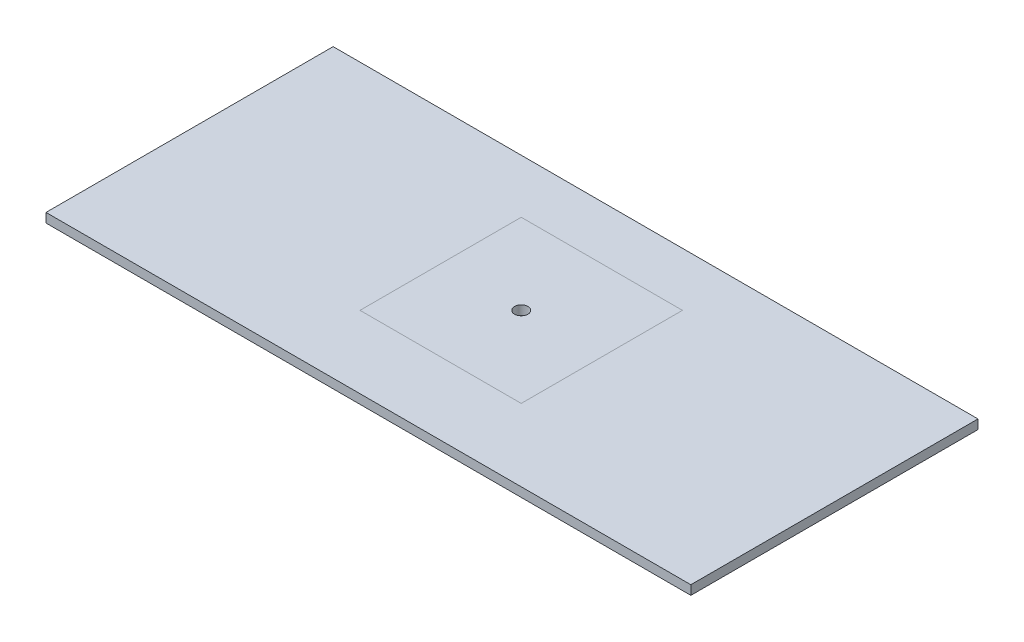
ISO-10303-21;
HEADER;
FILE_DESCRIPTION(('STEP AP214'),'2;1');
FILE_NAME('part.step','',(''),(''),'','','');
FILE_SCHEMA(('AUTOMOTIVE_DESIGN { 1 0 10303 214 1 1 1 1 }'));
ENDSEC;
DATA;
#1=APPLICATION_CONTEXT('core data for automotive mechanical design processes');
#2=APPLICATION_PROTOCOL_DEFINITION('international standard','automotive_design',2000,#1);
#3=PRODUCT_CONTEXT('',#1,'mechanical');
#4=PRODUCT('Part','Part','',(#3));
#5=PRODUCT_RELATED_PRODUCT_CATEGORY('part','',(#4));
#6=PRODUCT_DEFINITION_FORMATION('','',#4);
#7=PRODUCT_DEFINITION_CONTEXT('part definition',#1,'design');
#8=PRODUCT_DEFINITION('design','',#6,#7);
#9=PRODUCT_DEFINITION_SHAPE('','',#8);
#10=(LENGTH_UNIT() NAMED_UNIT(*) SI_UNIT(.MILLI.,.METRE.));
#11=(NAMED_UNIT(*) PLANE_ANGLE_UNIT() SI_UNIT($,.RADIAN.));
#12=(NAMED_UNIT(*) SI_UNIT($,.STERADIAN.) SOLID_ANGLE_UNIT());
#13=UNCERTAINTY_MEASURE_WITH_UNIT(LENGTH_MEASURE(1.E-05),#10,'distance_accuracy_value','');
#14=(GEOMETRIC_REPRESENTATION_CONTEXT(3) GLOBAL_UNCERTAINTY_ASSIGNED_CONTEXT((#13)) GLOBAL_UNIT_ASSIGNED_CONTEXT((#10,
#11,#12)) REPRESENTATION_CONTEXT('',''));
#15=CARTESIAN_POINT('',(0.,0.,0.));
#16=DIRECTION('',(0.,0.,1.));
#17=DIRECTION('',(1.,0.,0.));
#18=AXIS2_PLACEMENT_3D('',#15,#16,#17);
#19=CARTESIAN_POINT('',(-609.6,-8.73125,542.925));
#20=DIRECTION('',(-1.,0.,0.));
#21=DIRECTION('',(0.,0.,1.));
#22=AXIS2_PLACEMENT_3D('',#19,#20,#21);
#23=PLANE('',#22);
#24=DIRECTION('',(0.,1.,0.));
#25=VECTOR('',#24,1.);
#26=CARTESIAN_POINT('',(-609.6,-8.73125,0.));
#27=LINE('',#26,#25);
#28=CARTESIAN_POINT('',(-609.6,-8.73125,0.));
#29=VERTEX_POINT('',#28);
#30=CARTESIAN_POINT('',(-609.6,8.73125,0.));
#31=VERTEX_POINT('',#30);
#32=EDGE_CURVE('E148',#29,#31,#27,.T.);
#33=ORIENTED_EDGE('',*,*,#32,.F.);
#34=DIRECTION('',(0.,0.,-1.));
#35=VECTOR('',#34,1.);
#36=CARTESIAN_POINT('',(-609.6,-8.73125,542.925));
#37=LINE('',#36,#35);
#38=CARTESIAN_POINT('',(-609.6,-8.73125,542.925));
#39=VERTEX_POINT('',#38);
#40=EDGE_CURVE('E11',#39,#29,#37,.T.);
#41=ORIENTED_EDGE('',*,*,#40,.F.);
#42=DIRECTION('',(0.,1.,0.));
#43=VECTOR('',#42,1.);
#44=CARTESIAN_POINT('',(-609.6,-8.73125,542.925));
#45=LINE('',#44,#43);
#46=CARTESIAN_POINT('',(-609.6,8.73125,542.925));
#47=VERTEX_POINT('',#46);
#48=EDGE_CURVE('E149',#39,#47,#45,.T.);
#49=ORIENTED_EDGE('',*,*,#48,.T.);
#50=DIRECTION('',(0.,0.,-1.));
#51=VECTOR('',#50,1.);
#52=CARTESIAN_POINT('',(-609.6,8.73125,542.925));
#53=LINE('',#52,#51);
#54=EDGE_CURVE('E37',#47,#31,#53,.T.);
#55=ORIENTED_EDGE('',*,*,#54,.T.);
#56=EDGE_LOOP('',(#33,#41,#49,#55));
#57=FACE_BOUND('',#56,.T.);
#58=ADVANCED_FACE('F34',(#57),#23,.T.);
#59=CARTESIAN_POINT('',(-609.6,-8.73125,542.925));
#60=DIRECTION('',(0.,1.,0.));
#61=DIRECTION('',(0.,0.,1.));
#62=AXIS2_PLACEMENT_3D('',#59,#60,#61);
#63=PLANE('',#62);
#64=CARTESIAN_POINT('',(0.,-8.73125,254.));
#65=DIRECTION('',(0.,1.,0.));
#66=DIRECTION('',(0.,0.,1.));
#67=AXIS2_PLACEMENT_3D('',#64,#65,#66);
#68=CIRCLE('',#67,12.7);
#69=CARTESIAN_POINT('',(0.,-8.73125,266.7));
#70=VERTEX_POINT('',#69);
#71=EDGE_CURVE('E142',#70,#70,#68,.T.);
#72=ORIENTED_EDGE('',*,*,#71,.T.);
#73=EDGE_LOOP('',(#72));
#74=FACE_BOUND('',#73,.T.);
#75=DIRECTION('',(1.,0.,0.));
#76=VECTOR('',#75,1.);
#77=CARTESIAN_POINT('',(-609.6,-8.73125,0.));
#78=LINE('',#77,#76);
#79=CARTESIAN_POINT('',(609.6,-8.73125,0.));
#80=VERTEX_POINT('',#79);
#81=EDGE_CURVE('E152',#29,#80,#78,.T.);
#82=ORIENTED_EDGE('',*,*,#81,.T.);
#83=DIRECTION('',(0.,0.,-1.));
#84=VECTOR('',#83,1.);
#85=CARTESIAN_POINT('',(609.6,-8.73125,542.925));
#86=LINE('',#85,#84);
#87=CARTESIAN_POINT('',(609.6,-8.73125,542.925));
#88=VERTEX_POINT('',#87);
#89=EDGE_CURVE('E42',#88,#80,#86,.T.);
#90=ORIENTED_EDGE('',*,*,#89,.F.);
#91=DIRECTION('',(1.,0.,0.));
#92=VECTOR('',#91,1.);
#93=CARTESIAN_POINT('',(-609.6,-8.73125,542.925));
#94=LINE('',#93,#92);
#95=EDGE_CURVE('E156',#39,#88,#94,.T.);
#96=ORIENTED_EDGE('',*,*,#95,.F.);
#97=ORIENTED_EDGE('',*,*,#40,.T.);
#98=EDGE_LOOP('',(#82,#90,#96,#97));
#99=FACE_BOUND('',#98,.T.);
#100=ADVANCED_FACE('F176',(#74,#99),#63,.F.);
#101=CARTESIAN_POINT('',(609.6,-8.73125,542.925));
#102=DIRECTION('',(-1.,0.,0.));
#103=DIRECTION('',(0.,0.,1.));
#104=AXIS2_PLACEMENT_3D('',#101,#102,#103);
#105=PLANE('',#104);
#106=DIRECTION('',(0.,1.,0.));
#107=VECTOR('',#106,1.);
#108=CARTESIAN_POINT('',(609.6,-8.73125,0.));
#109=LINE('',#108,#107);
#110=CARTESIAN_POINT('',(609.6,8.73125,0.));
#111=VERTEX_POINT('',#110);
#112=EDGE_CURVE('E163',#80,#111,#109,.T.);
#113=ORIENTED_EDGE('',*,*,#112,.T.);
#114=DIRECTION('',(0.,0.,-1.));
#115=VECTOR('',#114,1.);
#116=CARTESIAN_POINT('',(609.6,8.73125,542.925));
#117=LINE('',#116,#115);
#118=CARTESIAN_POINT('',(609.6,8.73125,542.925));
#119=VERTEX_POINT('',#118);
#120=EDGE_CURVE('E168',#119,#111,#117,.T.);
#121=ORIENTED_EDGE('',*,*,#120,.F.);
#122=DIRECTION('',(0.,1.,0.));
#123=VECTOR('',#122,1.);
#124=CARTESIAN_POINT('',(609.6,-8.73125,542.925));
#125=LINE('',#124,#123);
#126=EDGE_CURVE('E154',#88,#119,#125,.T.);
#127=ORIENTED_EDGE('',*,*,#126,.F.);
#128=ORIENTED_EDGE('',*,*,#89,.T.);
#129=EDGE_LOOP('',(#113,#121,#127,#128));
#130=FACE_BOUND('',#129,.T.);
#131=ADVANCED_FACE('F179',(#130),#105,.F.);
#132=CARTESIAN_POINT('',(-609.6,8.73125,542.925));
#133=DIRECTION('',(0.,1.,0.));
#134=DIRECTION('',(0.,0.,1.));
#135=AXIS2_PLACEMENT_3D('',#132,#133,#134);
#136=PLANE('',#135);
#137=DIRECTION('',(0.,0.,-1.));
#138=VECTOR('',#137,1.);
#139=CARTESIAN_POINT('',(152.4,8.73125,406.4));
#140=LINE('',#139,#138);
#141=CARTESIAN_POINT('',(152.4,8.73125,406.4));
#142=VERTEX_POINT('',#141);
#143=CARTESIAN_POINT('',(152.4,8.73125,101.6));
#144=VERTEX_POINT('',#143);
#145=EDGE_CURVE('E50',#142,#144,#140,.T.);
#146=ORIENTED_EDGE('',*,*,#145,.F.);
#147=DIRECTION('',(1.,0.,0.));
#148=VECTOR('',#147,1.);
#149=CARTESIAN_POINT('',(-152.4,8.73125,406.4));
#150=LINE('',#149,#148);
#151=CARTESIAN_POINT('',(-152.4,8.73125,406.4));
#152=VERTEX_POINT('',#151);
#153=EDGE_CURVE('E125',#152,#142,#150,.T.);
#154=ORIENTED_EDGE('',*,*,#153,.F.);
#155=DIRECTION('',(0.,0.,1.));
#156=VECTOR('',#155,1.);
#157=CARTESIAN_POINT('',(-152.4,8.73125,406.4));
#158=LINE('',#157,#156);
#159=CARTESIAN_POINT('',(-152.4,8.73125,101.6));
#160=VERTEX_POINT('',#159);
#161=EDGE_CURVE('E128',#160,#152,#158,.T.);
#162=ORIENTED_EDGE('',*,*,#161,.F.);
#163=DIRECTION('',(-1.,0.,0.));
#164=VECTOR('',#163,1.);
#165=CARTESIAN_POINT('',(-152.4,8.73125,101.6));
#166=LINE('',#165,#164);
#167=EDGE_CURVE('E136',#144,#160,#166,.T.);
#168=ORIENTED_EDGE('',*,*,#167,.F.);
#169=EDGE_LOOP('',(#146,#154,#162,#168));
#170=FACE_BOUND('',#169,.T.);
#171=DIRECTION('',(1.,0.,0.));
#172=VECTOR('',#171,1.);
#173=CARTESIAN_POINT('',(-609.6,8.73125,0.));
#174=LINE('',#173,#172);
#175=EDGE_CURVE('E160',#31,#111,#174,.T.);
#176=ORIENTED_EDGE('',*,*,#175,.F.);
#177=ORIENTED_EDGE('',*,*,#54,.F.);
#178=DIRECTION('',(1.,0.,0.));
#179=VECTOR('',#178,1.);
#180=CARTESIAN_POINT('',(-609.6,8.73125,542.925));
#181=LINE('',#180,#179);
#182=EDGE_CURVE('E151',#47,#119,#181,.T.);
#183=ORIENTED_EDGE('',*,*,#182,.T.);
#184=ORIENTED_EDGE('',*,*,#120,.T.);
#185=EDGE_LOOP('',(#176,#177,#183,#184));
#186=FACE_BOUND('',#185,.T.);
#187=ADVANCED_FACE('F171',(#170,#186),#136,.T.);
#188=CARTESIAN_POINT('',(0.,0.,542.925));
#189=DIRECTION('',(0.,0.,-1.));
#190=DIRECTION('',(-1.,0.,0.));
#191=AXIS2_PLACEMENT_3D('',#188,#189,#190);
#192=PLANE('',#191);
#193=ORIENTED_EDGE('',*,*,#48,.F.);
#194=ORIENTED_EDGE('',*,*,#95,.T.);
#195=ORIENTED_EDGE('',*,*,#126,.T.);
#196=ORIENTED_EDGE('',*,*,#182,.F.);
#197=EDGE_LOOP('',(#193,#194,#195,#196));
#198=FACE_BOUND('',#197,.T.);
#199=ADVANCED_FACE('F181',(#198),#192,.F.);
#200=CARTESIAN_POINT('',(0.,0.,0.));
#201=DIRECTION('',(0.,0.,-1.));
#202=DIRECTION('',(-1.,0.,0.));
#203=AXIS2_PLACEMENT_3D('',#200,#201,#202);
#204=PLANE('',#203);
#205=ORIENTED_EDGE('',*,*,#32,.T.);
#206=ORIENTED_EDGE('',*,*,#175,.T.);
#207=ORIENTED_EDGE('',*,*,#112,.F.);
#208=ORIENTED_EDGE('',*,*,#81,.F.);
#209=EDGE_LOOP('',(#205,#206,#207,#208));
#210=FACE_BOUND('',#209,.T.);
#211=ADVANCED_FACE('F174',(#210),#204,.T.);
#212=CARTESIAN_POINT('',(0.,-8.73125,254.));
#213=DIRECTION('',(0.,1.,0.));
#214=DIRECTION('',(0.,0.,1.));
#215=AXIS2_PLACEMENT_3D('',#212,#213,#214);
#216=CYLINDRICAL_SURFACE('',#215,12.7);
#217=CARTESIAN_POINT('',(0.,8.730996,254.));
#218=DIRECTION('',(0.,1.,0.));
#219=DIRECTION('',(0.,0.,1.));
#220=AXIS2_PLACEMENT_3D('',#217,#218,#219);
#221=CIRCLE('',#220,12.7);
#222=CARTESIAN_POINT('',(0.,8.730996,266.7));
#223=VERTEX_POINT('',#222);
#224=EDGE_CURVE('E131',#223,#223,#221,.T.);
#225=ORIENTED_EDGE('',*,*,#224,.T.);
#226=EDGE_LOOP('',(#225));
#227=FACE_BOUND('',#226,.T.);
#228=ORIENTED_EDGE('',*,*,#71,.F.);
#229=EDGE_LOOP('',(#228));
#230=FACE_BOUND('',#229,.T.);
#231=ADVANCED_FACE('F188',(#227,#230),#216,.F.);
#232=CARTESIAN_POINT('',(152.4,8.730996,406.4));
#233=DIRECTION('',(1.,0.,0.));
#234=DIRECTION('',(0.,0.,-1.));
#235=AXIS2_PLACEMENT_3D('',#232,#233,#234);
#236=PLANE('',#235);
#237=ORIENTED_EDGE('',*,*,#145,.T.);
#238=DIRECTION('',(0.,1.,0.));
#239=VECTOR('',#238,1.);
#240=CARTESIAN_POINT('',(152.4,8.730996,101.6));
#241=LINE('',#240,#239);
#242=CARTESIAN_POINT('',(152.4,8.730996,101.6));
#243=VERTEX_POINT('',#242);
#244=EDGE_CURVE('E103',#243,#144,#241,.T.);
#245=ORIENTED_EDGE('',*,*,#244,.F.);
#246=DIRECTION('',(0.,0.,-1.));
#247=VECTOR('',#246,1.);
#248=CARTESIAN_POINT('',(152.4,8.730996,406.4));
#249=LINE('',#248,#247);
#250=CARTESIAN_POINT('',(152.4,8.730996,406.4));
#251=VERTEX_POINT('',#250);
#252=EDGE_CURVE('E107',#251,#243,#249,.T.);
#253=ORIENTED_EDGE('',*,*,#252,.F.);
#254=DIRECTION('',(0.,1.,0.));
#255=VECTOR('',#254,1.);
#256=CARTESIAN_POINT('',(152.4,8.730996,406.4));
#257=LINE('',#256,#255);
#258=EDGE_CURVE('E140',#251,#142,#257,.T.);
#259=ORIENTED_EDGE('',*,*,#258,.T.);
#260=EDGE_LOOP('',(#237,#245,#253,#259));
#261=FACE_BOUND('',#260,.T.);
#262=ADVANCED_FACE('F105',(#261),#236,.F.);
#263=CARTESIAN_POINT('',(-152.4,8.730996,406.4));
#264=DIRECTION('',(0.,0.,1.));
#265=DIRECTION('',(1.,0.,0.));
#266=AXIS2_PLACEMENT_3D('',#263,#264,#265);
#267=PLANE('',#266);
#268=ORIENTED_EDGE('',*,*,#153,.T.);
#269=ORIENTED_EDGE('',*,*,#258,.F.);
#270=DIRECTION('',(1.,0.,0.));
#271=VECTOR('',#270,1.);
#272=CARTESIAN_POINT('',(-152.4,8.730996,406.4));
#273=LINE('',#272,#271);
#274=CARTESIAN_POINT('',(-152.4,8.730996,406.4));
#275=VERTEX_POINT('',#274);
#276=EDGE_CURVE('E113',#275,#251,#273,.T.);
#277=ORIENTED_EDGE('',*,*,#276,.F.);
#278=DIRECTION('',(0.,1.,0.));
#279=VECTOR('',#278,1.);
#280=CARTESIAN_POINT('',(-152.4,8.730996,406.4));
#281=LINE('',#280,#279);
#282=EDGE_CURVE('E143',#275,#152,#281,.T.);
#283=ORIENTED_EDGE('',*,*,#282,.T.);
#284=EDGE_LOOP('',(#268,#269,#277,#283));
#285=FACE_BOUND('',#284,.T.);
#286=ADVANCED_FACE('F209',(#285),#267,.F.);
#287=CARTESIAN_POINT('',(-152.4,8.730996,406.4));
#288=DIRECTION('',(-1.,0.,0.));
#289=DIRECTION('',(0.,0.,1.));
#290=AXIS2_PLACEMENT_3D('',#287,#288,#289);
#291=PLANE('',#290);
#292=ORIENTED_EDGE('',*,*,#161,.T.);
#293=ORIENTED_EDGE('',*,*,#282,.F.);
#294=DIRECTION('',(0.,0.,1.));
#295=VECTOR('',#294,1.);
#296=CARTESIAN_POINT('',(-152.4,8.730996,406.4));
#297=LINE('',#296,#295);
#298=CARTESIAN_POINT('',(-152.4,8.730996,101.6));
#299=VERTEX_POINT('',#298);
#300=EDGE_CURVE('E121',#299,#275,#297,.T.);
#301=ORIENTED_EDGE('',*,*,#300,.F.);
#302=DIRECTION('',(0.,1.,0.));
#303=VECTOR('',#302,1.);
#304=CARTESIAN_POINT('',(-152.4,8.730996,101.6));
#305=LINE('',#304,#303);
#306=EDGE_CURVE('E112',#299,#160,#305,.T.);
#307=ORIENTED_EDGE('',*,*,#306,.T.);
#308=EDGE_LOOP('',(#292,#293,#301,#307));
#309=FACE_BOUND('',#308,.T.);
#310=ADVANCED_FACE('F215',(#309),#291,.F.);
#311=CARTESIAN_POINT('',(-152.4,8.730996,101.6));
#312=DIRECTION('',(0.,0.,-1.));
#313=DIRECTION('',(-1.,0.,0.));
#314=AXIS2_PLACEMENT_3D('',#311,#312,#313);
#315=PLANE('',#314);
#316=ORIENTED_EDGE('',*,*,#167,.T.);
#317=ORIENTED_EDGE('',*,*,#306,.F.);
#318=DIRECTION('',(-1.,0.,0.));
#319=VECTOR('',#318,1.);
#320=CARTESIAN_POINT('',(-152.4,8.730996,101.6));
#321=LINE('',#320,#319);
#322=EDGE_CURVE('E116',#243,#299,#321,.T.);
#323=ORIENTED_EDGE('',*,*,#322,.F.);
#324=ORIENTED_EDGE('',*,*,#244,.T.);
#325=EDGE_LOOP('',(#316,#317,#323,#324));
#326=FACE_BOUND('',#325,.T.);
#327=ADVANCED_FACE('F117',(#326),#315,.F.);
#328=CARTESIAN_POINT('',(0.,8.730996,0.));
#329=DIRECTION('',(0.,-1.,0.));
#330=DIRECTION('',(0.,0.,-1.));
#331=AXIS2_PLACEMENT_3D('',#328,#329,#330);
#332=PLANE('',#331);
#333=ORIENTED_EDGE('',*,*,#224,.F.);
#334=EDGE_LOOP('',(#333));
#335=FACE_BOUND('',#334,.T.);
#336=ORIENTED_EDGE('',*,*,#252,.T.);
#337=ORIENTED_EDGE('',*,*,#322,.T.);
#338=ORIENTED_EDGE('',*,*,#300,.T.);
#339=ORIENTED_EDGE('',*,*,#276,.T.);
#340=EDGE_LOOP('',(#336,#337,#338,#339));
#341=FACE_BOUND('',#340,.T.);
#342=ADVANCED_FACE('F123',(#335,#341),#332,.F.);
#343=CLOSED_SHELL('',(#58,#100,#131,#187,#199,#211,#231,#262,#286,#310,#327,#342));
#344=MANIFOLD_SOLID_BREP('B2',#343);
#345=ADVANCED_BREP_SHAPE_REPRESENTATION('',(#18,#344),#14);
#346=SHAPE_DEFINITION_REPRESENTATION(#9,#345);
ENDSEC;
END-ISO-10303-21;
